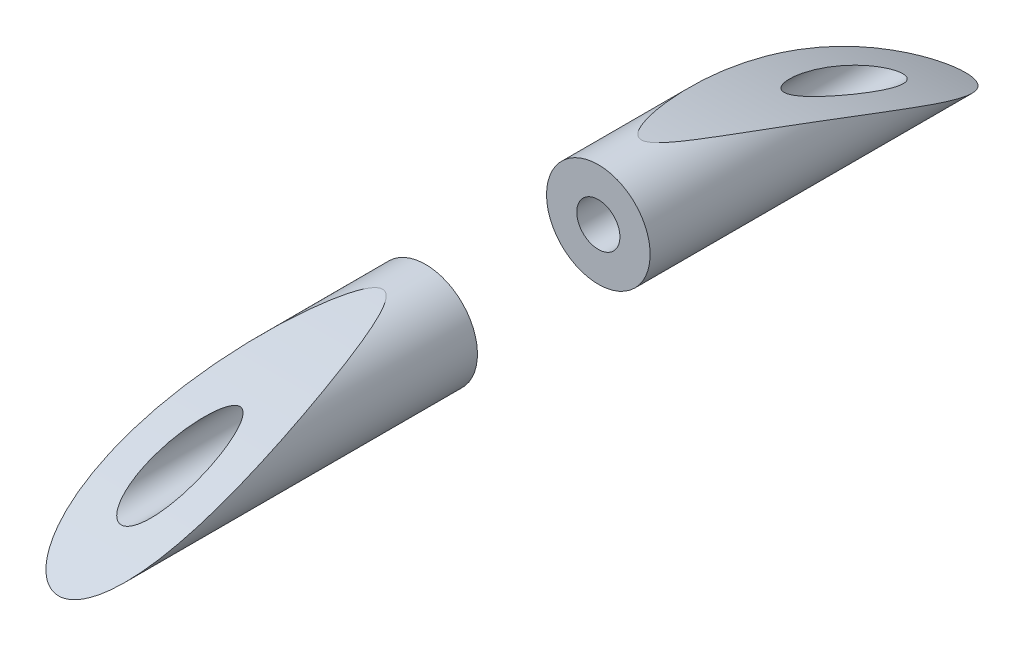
from build123d import *

# Parameters (mm, degrees)
ESQUISSE1_R                  = 1.2
ESQUISSE1_R_2                = 0.5
BOSS_EXTRU_1_DEPTH           = 10.5
ENL_V_MAT_EXTRU_1_DEPTH      = 21
ENL_V_MAT_EXTRU_1_DEPTH_BACK = 21
ESQUISSE2_W                  = 54.099494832
ESQUISSE2_H                  = 59.093323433
ESQUISSE2_R                  = 22.5
ENL_V_MAT_EXTRU_2_DEPTH      = 11.636258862
ENL_V_MAT_EXTRU_2_DEPTH_BACK = 11.636258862
ESQUISSE3_W                  = 4
ESQUISSE3_H                  = 10.03654494


with BuildPart() as part:
    # Esquisse1 → Boss.-Extru.1 (new, symmetric)
    with BuildSketch(Plane.XY):
        with Locations(Location((0, 0, 0), (0, 0, 180))):
            Circle(ESQUISSE1_R)
        Circle(ESQUISSE1_R_2, mode=Mode.SUBTRACT)
    extrude(amount=BOSS_EXTRU_1_DEPTH, both=True)

    # Esquisse2 → Enl_v. mat.-Extru.1 (cut, two sides: drawn at the far end of the back side and taken through both)
    with BuildSketch(Plane(origin=(0, 0, 0), x_dir=(0, 0, -1), z_dir=(1, 0, 0)).offset(-ENL_V_MAT_EXTRU_1_DEPTH_BACK)):
        with Locations((0, -21.099748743)):
            Rectangle(ESQUISSE2_W, ESQUISSE2_H)
        with Locations((0, -21.099748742)):
            Circle(ESQUISSE2_R, mode=Mode.SUBTRACT)
    extrude(amount=ENL_V_MAT_EXTRU_1_DEPTH + ENL_V_MAT_EXTRU_1_DEPTH_BACK, mode=Mode.SUBTRACT)

    # Esquisse3 → Enl_v. mat.-Extru.2 (cut, two sides: drawn at the far end of the back side and taken through both)
    with BuildSketch(Plane(origin=(0, 0, 0), x_dir=(0, 0, -1), z_dir=(1, 0, 0)).offset(-ENL_V_MAT_EXTRU_2_DEPTH_BACK)):
        Rectangle(ESQUISSE3_W, ESQUISSE3_H)
    extrude(amount=ENL_V_MAT_EXTRU_2_DEPTH + ENL_V_MAT_EXTRU_2_DEPTH_BACK, mode=Mode.SUBTRACT)


with BuildPart() as enl_v_mat_extru_2_piece_1:
    # of the separate pieces the step leaves, piece 1, a body of its own (enl_v_mat_extru_2_pieces)
    add(part.part.solids().sort_by_distance((-1.2, 0, 2))[0])


with BuildPart() as enl_v_mat_extru_2_piece_2:
    # of the separate pieces the step leaves, piece 2, a body of its own (enl_v_mat_extru_2_pieces)
    add(part.part.solids().sort_by_distance((-1.2, 0, -7.813488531))[0])


solid = Compound([enl_v_mat_extru_2_piece_1.part, enl_v_mat_extru_2_piece_2.part])
